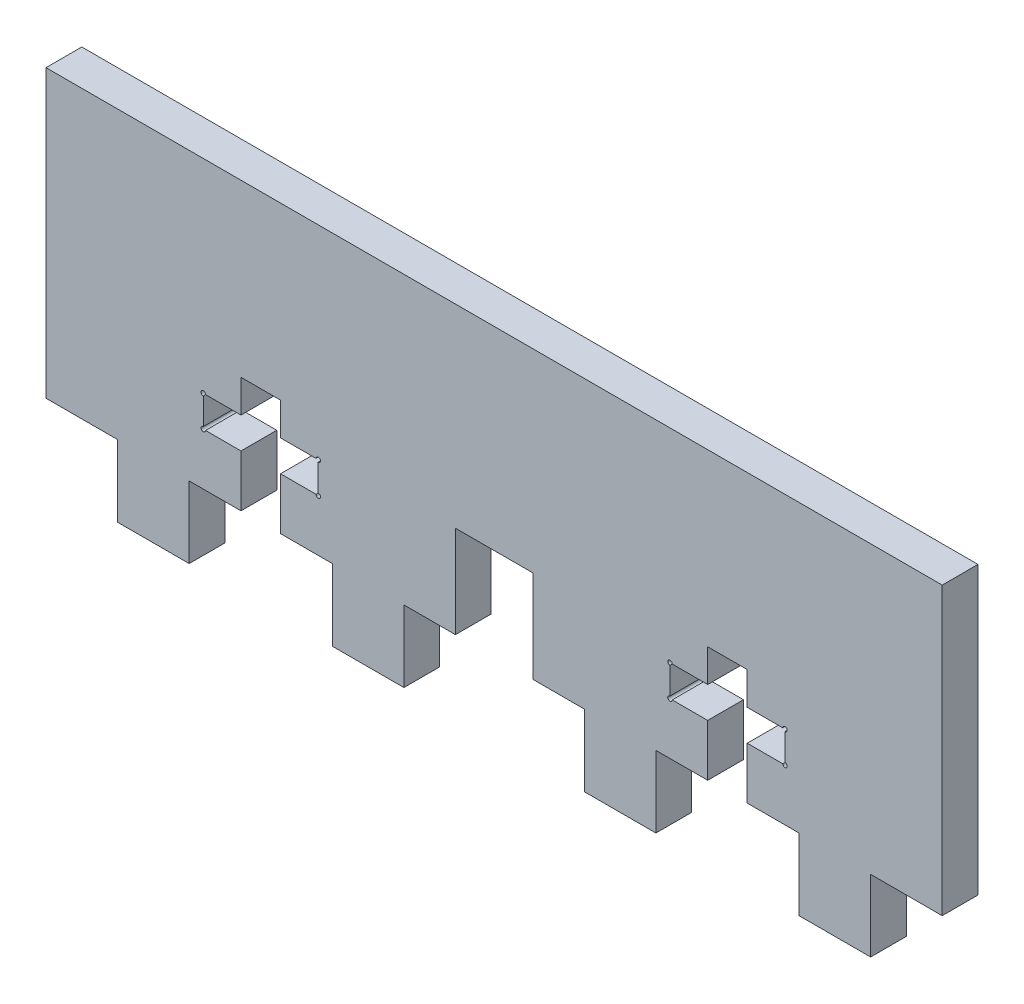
from build123d import *

# Parameters (mm, degrees)
SKETCH1_W           = 79.502
SKETCH1_H           = 25.4
BOSS_EXTRUDE1_DEPTH = 3.175
SKETCH2_W           = 6.35
SKETCH2_H           = 6.35
BOSS_EXTRUDE2_DEPTH = 3.175
SKETCH3_W           = 6.858
SKETCH3_H           = 8.1788
CUT_EXTRUDE1_DEPTH  = 9.017
SKETCH4_R           = 0.19812
CUT_EXTRUDE2_DEPTH  = 6.604
SCALE1_SCALE        = 0.5


with BuildPart() as part:
    # Sketch1 → Boss-Extrude1 (new body)
    with BuildSketch(Plane.XY):
        with Locations((-8.776255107, 4.35571396)):
            Rectangle(SKETCH1_W, SKETCH1_H)
    extrude(amount=BOSS_EXTRUDE1_DEPTH)

    # Sketch2 → Boss-Extrude2 (add)
    with BuildSketch(Plane.XY):
        with Locations((-39.002255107, -11.51928604)):
            Rectangle(SKETCH2_W, SKETCH2_H)
        with Locations((-19.952255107, -11.51928604)):
            Rectangle(SKETCH2_W, SKETCH2_H)
        with Locations((2.399744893, -11.51928604)):
            Rectangle(SKETCH2_W, SKETCH2_H)
        with Locations((21.449744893, -11.51928604)):
            Rectangle(SKETCH2_W, SKETCH2_H)
    extrude(amount=BOSS_EXTRUDE2_DEPTH)

    # Sketch3 → Cut-Extrude1 (cut)
    with BuildSketch(Plane.XY):
        Polygon((10.172144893, -8.34428604), (10.172144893, -3.74180604), (6.825160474, -3.74180604), (6.825160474, -0.98590604), (10.172144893, -0.98590604), (10.172144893, 1.91477396), (13.677344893, 1.91477396), (13.677344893, -0.98590604), (17.024329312, -0.98590604), (17.024329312, -3.74180604), (13.677344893, -3.74180604), (13.677344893, -8.34428604), align=None)
        Polygon((-31.229855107, -8.34428604), (-31.229855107, -3.74180604), (-34.576839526, -3.74180604), (-34.576839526, -0.98590604), (-31.229855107, -0.98590604), (-31.229855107, 1.91477396), (-27.724655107, 1.91477396), (-27.724655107, -0.98590604), (-24.377670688, -0.98590604), (-24.377670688, -3.74180604), (-27.724655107, -3.74180604), (-27.724655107, -8.34428604), align=None)
        with Locations((-8.776255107, -4.25488604)):
            Rectangle(SKETCH3_W, SKETCH3_H)
    extrude(amount=CUT_EXTRUDE1_DEPTH, mode=Mode.SUBTRACT)

    # Sketch4 → Cut-Extrude2 (cut)
    with BuildSketch(Plane.XY):
        with Locations((-34.576839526, -0.98590604)):
            Circle(SKETCH4_R)
        with Locations((-34.576839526, -3.74180604)):
            Circle(SKETCH4_R)
        with Locations((-24.377670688, -0.98590604)):
            Circle(SKETCH4_R)
        with Locations((-24.377670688, -3.74180604)):
            Circle(SKETCH4_R)
        with Locations((6.825160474, -0.98590604)):
            Circle(SKETCH4_R)
        with Locations((6.825160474, -3.74180604)):
            Circle(SKETCH4_R)
        with Locations((17.024329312, -0.98590604)):
            Circle(SKETCH4_R)
        with Locations((17.024329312, -3.74180604)):
            Circle(SKETCH4_R)
    extrude(amount=CUT_EXTRUDE2_DEPTH, mode=Mode.SUBTRACT)


with BuildPart() as part_1:
    # Scale1: scaled about (-8.776255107, 3.720405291, 1.5875)
    add(part.part.scale(SCALE1_SCALE).moved(Location((-4.388127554, 1.860202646, 0.79375))))


solid = part_1.part
